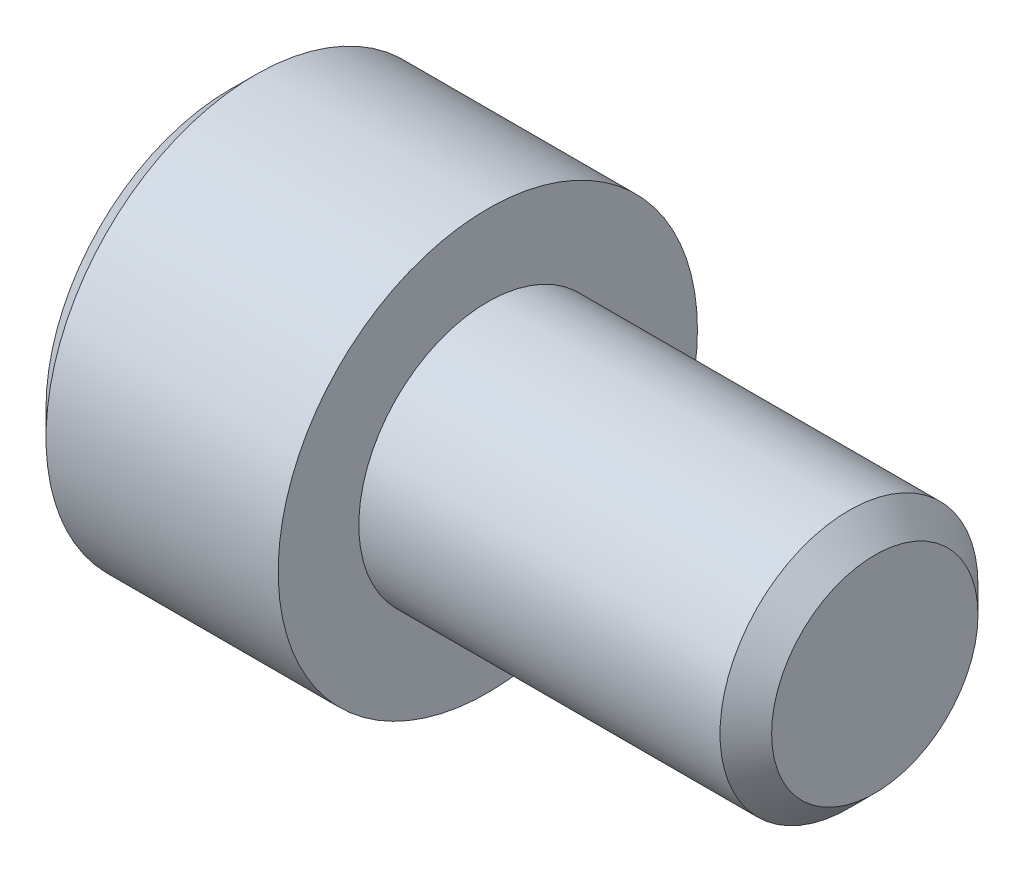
from build123d import *


with BuildPart() as part:
    # Sketch1 → Revolve1 (revolve)
    with BuildSketch(Plane.XY, mode=Mode.PRIVATE) as revolve1_sk:
        Polygon((0, 0), (0, 5.7), (0.8, 6.5), (8, 6.5), (8, 4), (19.2, 4), (20, 3.2), (20, 0), align=None)
    revolve(revolve1_sk.sketch.rotate(Axis((20, 0, 0), (-1, 0, 0)), 90), axis=Axis((20, 0, 0), (-1, 0, 0)))


solid = part.part
